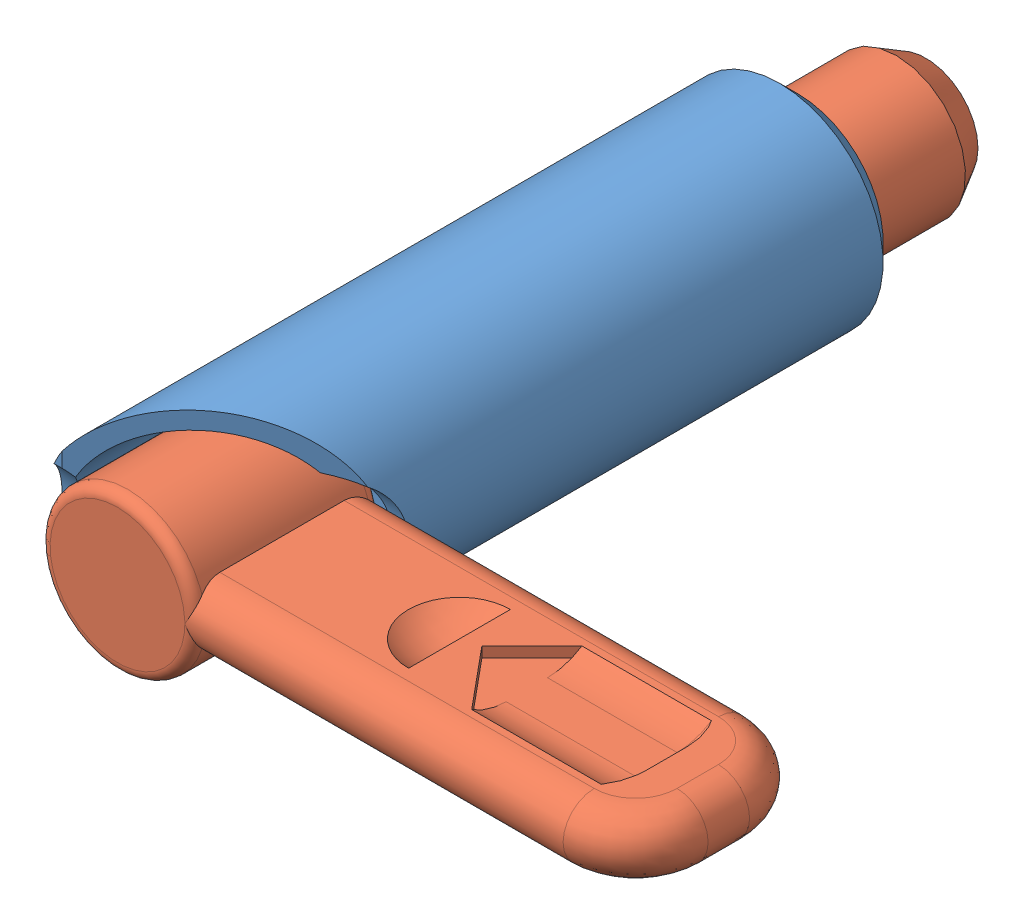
SolidWorks assembly GDX12L-8N-SUS.sldasm, configuration Default (file format 15000). Lengths in mm.
Overall size (36 12.01 47.41).
2 component instances, 2 part files, 0 mates.
Components (placement in the parent):
- GDX12L-8N-SUS_01-1: GDX12L-8N-SUS_01.SLDPRT [ﾃﾞﾌｫﾙﾄ] x (1 0 0) z (0 -1 0) size (12.02 39.35 12.01)
- GDX12L-8N-SUS_02-1: GDX12L-8N-SUS_02.SLDPRT [ﾃﾞﾌｫﾙﾄ] x (1 0 0) z (0 -1 0) size (34.5 47.41 9)
